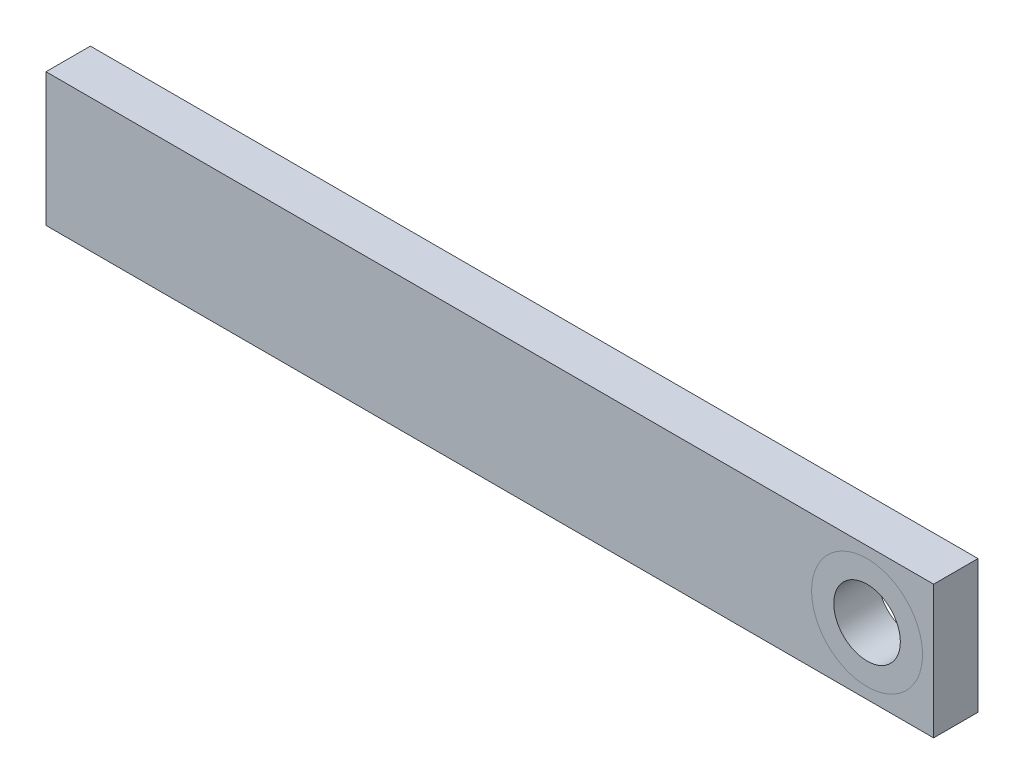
ISO-10303-21;
HEADER;
FILE_DESCRIPTION(('STEP AP214'),'2;1');
FILE_NAME('part.step','',(''),(''),'','','');
FILE_SCHEMA(('AUTOMOTIVE_DESIGN { 1 0 10303 214 1 1 1 1 }'));
ENDSEC;
DATA;
#1=APPLICATION_CONTEXT('core data for automotive mechanical design processes');
#2=APPLICATION_PROTOCOL_DEFINITION('international standard','automotive_design',2000,#1);
#3=PRODUCT_CONTEXT('',#1,'mechanical');
#4=PRODUCT('Part','Part','',(#3));
#5=PRODUCT_RELATED_PRODUCT_CATEGORY('part','',(#4));
#6=PRODUCT_DEFINITION_FORMATION('','',#4);
#7=PRODUCT_DEFINITION_CONTEXT('part definition',#1,'design');
#8=PRODUCT_DEFINITION('design','',#6,#7);
#9=PRODUCT_DEFINITION_SHAPE('','',#8);
#10=(LENGTH_UNIT() NAMED_UNIT(*) SI_UNIT(.MILLI.,.METRE.));
#11=(NAMED_UNIT(*) PLANE_ANGLE_UNIT() SI_UNIT($,.RADIAN.));
#12=(NAMED_UNIT(*) SI_UNIT($,.STERADIAN.) SOLID_ANGLE_UNIT());
#13=UNCERTAINTY_MEASURE_WITH_UNIT(LENGTH_MEASURE(1.E-05),#10,'distance_accuracy_value','');
#14=(GEOMETRIC_REPRESENTATION_CONTEXT(3) GLOBAL_UNCERTAINTY_ASSIGNED_CONTEXT((#13)) GLOBAL_UNIT_ASSIGNED_CONTEXT((#10,
#11,#12)) REPRESENTATION_CONTEXT('',''));
#15=CARTESIAN_POINT('',(0.,0.,0.));
#16=DIRECTION('',(0.,0.,1.));
#17=DIRECTION('',(1.,0.,0.));
#18=AXIS2_PLACEMENT_3D('',#15,#16,#17);
#19=CARTESIAN_POINT('',(0.,30.,10.));
#20=DIRECTION('',(0.,0.,-1.));
#21=DIRECTION('',(-1.,0.,0.));
#22=AXIS2_PLACEMENT_3D('',#19,#20,#21);
#23=PLANE('',#22);
#24=DIRECTION('',(0.,-1.,0.));
#25=VECTOR('',#24,1.);
#26=CARTESIAN_POINT('',(0.,0.,10.));
#27=LINE('',#26,#25);
#28=CARTESIAN_POINT('',(0.,30.,10.));
#29=VERTEX_POINT('',#28);
#30=CARTESIAN_POINT('',(0.,0.,10.));
#31=VERTEX_POINT('',#30);
#32=EDGE_CURVE('E101',#29,#31,#27,.T.);
#33=ORIENTED_EDGE('',*,*,#32,.T.);
#34=DIRECTION('',(1.,0.,0.));
#35=VECTOR('',#34,1.);
#36=CARTESIAN_POINT('',(0.,0.,10.));
#37=LINE('',#36,#35);
#38=CARTESIAN_POINT('',(200.,0.,10.));
#39=VERTEX_POINT('',#38);
#40=EDGE_CURVE('E85',#31,#39,#37,.T.);
#41=ORIENTED_EDGE('',*,*,#40,.T.);
#42=DIRECTION('',(0.,1.,0.));
#43=VECTOR('',#42,1.);
#44=CARTESIAN_POINT('',(200.,0.,10.));
#45=LINE('',#44,#43);
#46=CARTESIAN_POINT('',(200.,30.,10.));
#47=VERTEX_POINT('',#46);
#48=EDGE_CURVE('E51',#39,#47,#45,.T.);
#49=ORIENTED_EDGE('',*,*,#48,.T.);
#50=DIRECTION('',(-1.,0.,0.));
#51=VECTOR('',#50,1.);
#52=CARTESIAN_POINT('',(0.,30.,10.));
#53=LINE('',#52,#51);
#54=EDGE_CURVE('E46',#47,#29,#53,.T.);
#55=ORIENTED_EDGE('',*,*,#54,.T.);
#56=EDGE_LOOP('',(#33,#41,#49,#55));
#57=FACE_BOUND('',#56,.T.);
#58=CARTESIAN_POINT('',(185.,15.,10.));
#59=DIRECTION('',(0.,0.,-1.));
#60=DIRECTION('',(-1.,0.,0.));
#61=AXIS2_PLACEMENT_3D('',#58,#59,#60);
#62=CIRCLE('',#61,12.5);
#63=CARTESIAN_POINT('',(172.5,15.,10.));
#64=VERTEX_POINT('',#63);
#65=EDGE_CURVE('E11',#64,#64,#62,.F.);
#66=ORIENTED_EDGE('',*,*,#65,.F.);
#67=EDGE_LOOP('',(#66));
#68=FACE_BOUND('',#67,.T.);
#69=ADVANCED_FACE('F30',(#57,#68),#23,.F.);
#70=CARTESIAN_POINT('',(0.,0.,10.));
#71=DIRECTION('',(1.,0.,0.));
#72=DIRECTION('',(0.,0.,-1.));
#73=AXIS2_PLACEMENT_3D('',#70,#71,#72);
#74=PLANE('',#73);
#75=DIRECTION('',(0.,-1.,0.));
#76=VECTOR('',#75,1.);
#77=CARTESIAN_POINT('',(0.,0.,0.));
#78=LINE('',#77,#76);
#79=CARTESIAN_POINT('',(0.,30.,0.));
#80=VERTEX_POINT('',#79);
#81=CARTESIAN_POINT('',(0.,0.,0.));
#82=VERTEX_POINT('',#81);
#83=EDGE_CURVE('E77',#80,#82,#78,.T.);
#84=ORIENTED_EDGE('',*,*,#83,.T.);
#85=DIRECTION('',(0.,0.,-1.));
#86=VECTOR('',#85,1.);
#87=CARTESIAN_POINT('',(0.,0.,10.));
#88=LINE('',#87,#86);
#89=EDGE_CURVE('E39',#31,#82,#88,.T.);
#90=ORIENTED_EDGE('',*,*,#89,.F.);
#91=ORIENTED_EDGE('',*,*,#32,.F.);
#92=DIRECTION('',(0.,0.,-1.));
#93=VECTOR('',#92,1.);
#94=CARTESIAN_POINT('',(0.,30.,10.));
#95=LINE('',#94,#93);
#96=EDGE_CURVE('E90',#29,#80,#95,.T.);
#97=ORIENTED_EDGE('',*,*,#96,.T.);
#98=EDGE_LOOP('',(#84,#90,#91,#97));
#99=FACE_BOUND('',#98,.T.);
#100=ADVANCED_FACE('F32',(#99),#74,.F.);
#101=CARTESIAN_POINT('',(0.,0.,10.));
#102=DIRECTION('',(0.,1.,0.));
#103=DIRECTION('',(0.,0.,1.));
#104=AXIS2_PLACEMENT_3D('',#101,#102,#103);
#105=PLANE('',#104);
#106=DIRECTION('',(1.,0.,0.));
#107=VECTOR('',#106,1.);
#108=CARTESIAN_POINT('',(0.,0.,0.));
#109=LINE('',#108,#107);
#110=CARTESIAN_POINT('',(200.,0.,0.));
#111=VERTEX_POINT('',#110);
#112=EDGE_CURVE('E72',#82,#111,#109,.T.);
#113=ORIENTED_EDGE('',*,*,#112,.T.);
#114=DIRECTION('',(0.,0.,-1.));
#115=VECTOR('',#114,1.);
#116=CARTESIAN_POINT('',(200.,0.,10.));
#117=LINE('',#116,#115);
#118=EDGE_CURVE('E88',#39,#111,#117,.T.);
#119=ORIENTED_EDGE('',*,*,#118,.F.);
#120=ORIENTED_EDGE('',*,*,#40,.F.);
#121=ORIENTED_EDGE('',*,*,#89,.T.);
#122=EDGE_LOOP('',(#113,#119,#120,#121));
#123=FACE_BOUND('',#122,.T.);
#124=ADVANCED_FACE('F84',(#123),#105,.F.);
#125=CARTESIAN_POINT('',(200.,0.,10.));
#126=DIRECTION('',(-1.,0.,0.));
#127=DIRECTION('',(0.,0.,1.));
#128=AXIS2_PLACEMENT_3D('',#125,#126,#127);
#129=PLANE('',#128);
#130=DIRECTION('',(0.,1.,0.));
#131=VECTOR('',#130,1.);
#132=CARTESIAN_POINT('',(200.,0.,0.));
#133=LINE('',#132,#131);
#134=CARTESIAN_POINT('',(200.,30.,0.));
#135=VERTEX_POINT('',#134);
#136=EDGE_CURVE('E78',#111,#135,#133,.T.);
#137=ORIENTED_EDGE('',*,*,#136,.T.);
#138=DIRECTION('',(0.,0.,-1.));
#139=VECTOR('',#138,1.);
#140=CARTESIAN_POINT('',(200.,30.,10.));
#141=LINE('',#140,#139);
#142=EDGE_CURVE('E107',#47,#135,#141,.T.);
#143=ORIENTED_EDGE('',*,*,#142,.F.);
#144=ORIENTED_EDGE('',*,*,#48,.F.);
#145=ORIENTED_EDGE('',*,*,#118,.T.);
#146=EDGE_LOOP('',(#137,#143,#144,#145));
#147=FACE_BOUND('',#146,.T.);
#148=ADVANCED_FACE('F111',(#147),#129,.F.);
#149=CARTESIAN_POINT('',(0.,30.,10.));
#150=DIRECTION('',(0.,-1.,0.));
#151=DIRECTION('',(0.,0.,-1.));
#152=AXIS2_PLACEMENT_3D('',#149,#150,#151);
#153=PLANE('',#152);
#154=DIRECTION('',(-1.,0.,0.));
#155=VECTOR('',#154,1.);
#156=CARTESIAN_POINT('',(0.,30.,0.));
#157=LINE('',#156,#155);
#158=EDGE_CURVE('E99',#135,#80,#157,.T.);
#159=ORIENTED_EDGE('',*,*,#158,.T.);
#160=ORIENTED_EDGE('',*,*,#96,.F.);
#161=ORIENTED_EDGE('',*,*,#54,.F.);
#162=ORIENTED_EDGE('',*,*,#142,.T.);
#163=EDGE_LOOP('',(#159,#160,#161,#162));
#164=FACE_BOUND('',#163,.T.);
#165=ADVANCED_FACE('F113',(#164),#153,.F.);
#166=ORIENTED_EDGE('',*,*,#65,.T.);
#167=EDGE_LOOP('',(#166));
#168=FACE_BOUND('',#167,.T.);
#169=CARTESIAN_POINT('',(185.,15.,10.));
#170=DIRECTION('',(0.,0.,1.));
#171=DIRECTION('',(1.,0.,0.));
#172=AXIS2_PLACEMENT_3D('',#169,#170,#171);
#173=CIRCLE('',#172,7.50000000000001);
#174=CARTESIAN_POINT('',(192.5,15.,10.));
#175=VERTEX_POINT('',#174);
#176=EDGE_CURVE('E94',#175,#175,#173,.T.);
#177=ORIENTED_EDGE('',*,*,#176,.F.);
#178=EDGE_LOOP('',(#177));
#179=FACE_BOUND('',#178,.T.);
#180=ADVANCED_FACE('F117',(#168,#179),#23,.F.);
#181=CARTESIAN_POINT('',(0.,30.,0.));
#182=DIRECTION('',(0.,0.,-1.));
#183=DIRECTION('',(-1.,0.,0.));
#184=AXIS2_PLACEMENT_3D('',#181,#182,#183);
#185=PLANE('',#184);
#186=CARTESIAN_POINT('',(185.,15.,0.));
#187=DIRECTION('',(0.,0.,1.));
#188=DIRECTION('',(1.,0.,0.));
#189=AXIS2_PLACEMENT_3D('',#186,#187,#188);
#190=CIRCLE('',#189,7.50000000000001);
#191=CARTESIAN_POINT('',(192.5,15.,0.));
#192=VERTEX_POINT('',#191);
#193=EDGE_CURVE('E91',#192,#192,#190,.T.);
#194=ORIENTED_EDGE('',*,*,#193,.T.);
#195=EDGE_LOOP('',(#194));
#196=FACE_BOUND('',#195,.T.);
#197=ORIENTED_EDGE('',*,*,#83,.F.);
#198=ORIENTED_EDGE('',*,*,#158,.F.);
#199=ORIENTED_EDGE('',*,*,#136,.F.);
#200=ORIENTED_EDGE('',*,*,#112,.F.);
#201=EDGE_LOOP('',(#197,#198,#199,#200));
#202=FACE_BOUND('',#201,.T.);
#203=ADVANCED_FACE('F74',(#196,#202),#185,.T.);
#204=CARTESIAN_POINT('',(185.,15.,0.));
#205=DIRECTION('',(0.,0.,1.));
#206=DIRECTION('',(1.,0.,0.));
#207=AXIS2_PLACEMENT_3D('',#204,#205,#206);
#208=CYLINDRICAL_SURFACE('',#207,7.50000000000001);
#209=ORIENTED_EDGE('',*,*,#193,.F.);
#210=EDGE_LOOP('',(#209));
#211=FACE_BOUND('',#210,.T.);
#212=ORIENTED_EDGE('',*,*,#176,.T.);
#213=EDGE_LOOP('',(#212));
#214=FACE_BOUND('',#213,.T.);
#215=ADVANCED_FACE('F125',(#211,#214),#208,.F.);
#216=CLOSED_SHELL('',(#69,#100,#124,#148,#165,#180,#203,#215));
#217=MANIFOLD_SOLID_BREP('B2',#216);
#218=ADVANCED_BREP_SHAPE_REPRESENTATION('',(#18,#217),#14);
#219=SHAPE_DEFINITION_REPRESENTATION(#9,#218);
ENDSEC;
END-ISO-10303-21;
